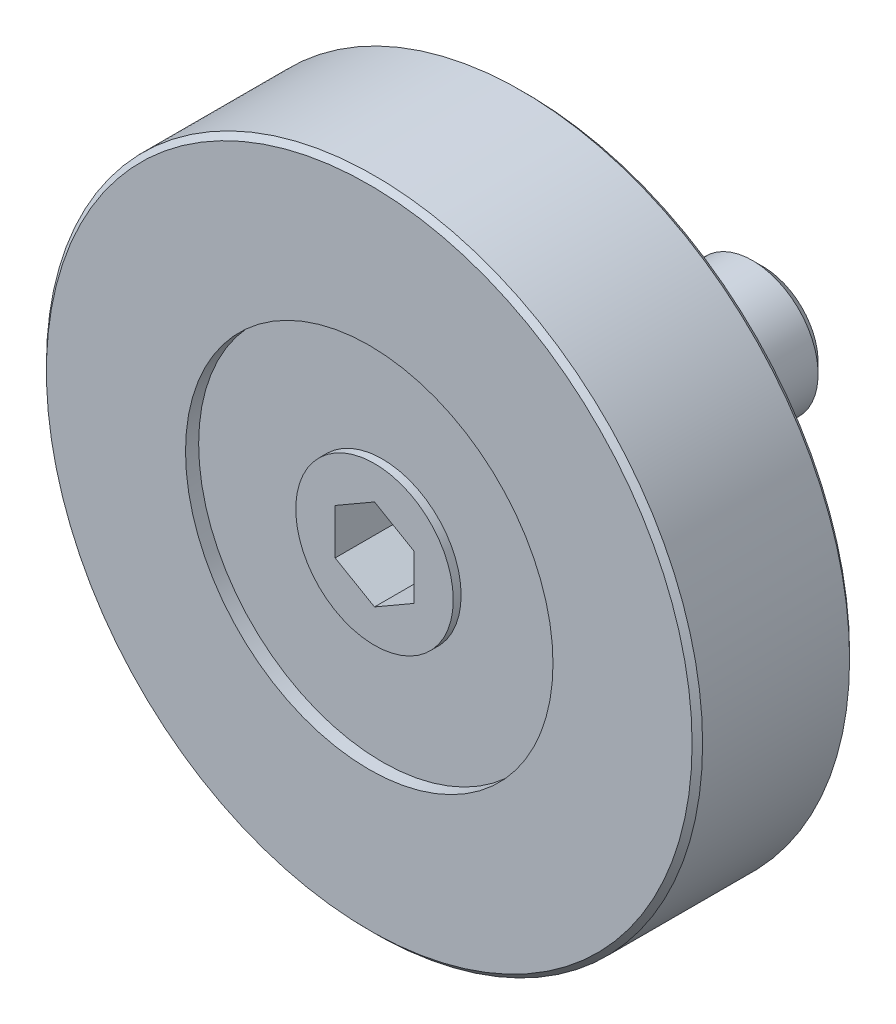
ISO-10303-21;
HEADER;
FILE_DESCRIPTION(('STEP AP214'),'2;1');
FILE_NAME('part.step','',(''),(''),'','','');
FILE_SCHEMA(('AUTOMOTIVE_DESIGN { 1 0 10303 214 1 1 1 1 }'));
ENDSEC;
DATA;
#1=APPLICATION_CONTEXT('core data for automotive mechanical design processes');
#2=APPLICATION_PROTOCOL_DEFINITION('international standard','automotive_design',2000,#1);
#3=PRODUCT_CONTEXT('',#1,'mechanical');
#4=PRODUCT('Part','Part','',(#3));
#5=PRODUCT_RELATED_PRODUCT_CATEGORY('part','',(#4));
#6=PRODUCT_DEFINITION_FORMATION('','',#4);
#7=PRODUCT_DEFINITION_CONTEXT('part definition',#1,'design');
#8=PRODUCT_DEFINITION('design','',#6,#7);
#9=PRODUCT_DEFINITION_SHAPE('','',#8);
#10=(LENGTH_UNIT() NAMED_UNIT(*) SI_UNIT(.MILLI.,.METRE.));
#11=(NAMED_UNIT(*) PLANE_ANGLE_UNIT() SI_UNIT($,.RADIAN.));
#12=(NAMED_UNIT(*) SI_UNIT($,.STERADIAN.) SOLID_ANGLE_UNIT());
#13=UNCERTAINTY_MEASURE_WITH_UNIT(LENGTH_MEASURE(1.E-05),#10,'distance_accuracy_value','');
#14=(GEOMETRIC_REPRESENTATION_CONTEXT(3) GLOBAL_UNCERTAINTY_ASSIGNED_CONTEXT((#13)) GLOBAL_UNIT_ASSIGNED_CONTEXT((#10,
#11,#12)) REPRESENTATION_CONTEXT('',''));
#15=CARTESIAN_POINT('',(0.,0.,0.));
#16=DIRECTION('',(0.,0.,1.));
#17=DIRECTION('',(1.,0.,0.));
#18=AXIS2_PLACEMENT_3D('',#15,#16,#17);
#19=CARTESIAN_POINT('',(0.,3.99999999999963,-3.05311331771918E-13));
#20=DIRECTION('',(0.,0.,1.));
#21=DIRECTION('',(1.,0.,0.));
#22=AXIS2_PLACEMENT_3D('',#19,#20,#21);
#23=PLANE('',#22);
#24=CARTESIAN_POINT('',(0.,0.,-3.05311331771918E-13));
#25=DIRECTION('',(0.,0.,1.));
#26=DIRECTION('',(1.,0.,0.));
#27=AXIS2_PLACEMENT_3D('',#24,#25,#26);
#28=CIRCLE('',#27,3.99999999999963);
#29=CARTESIAN_POINT('',(3.99999999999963,0.,-3.05311331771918E-13));
#30=VERTEX_POINT('',#29);
#31=EDGE_CURVE('E9',#30,#30,#28,.T.);
#32=ORIENTED_EDGE('',*,*,#31,.F.);
#33=EDGE_LOOP('',(#32));
#34=FACE_BOUND('',#33,.T.);
#35=CARTESIAN_POINT('',(0.,0.,-3.05311331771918E-13));
#36=DIRECTION('',(0.,0.,-1.));
#37=DIRECTION('',(-1.,0.,0.));
#38=AXIS2_PLACEMENT_3D('',#35,#36,#37);
#39=CIRCLE('',#38,2.);
#40=CARTESIAN_POINT('',(-2.,0.,-3.05311331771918E-13));
#41=VERTEX_POINT('',#40);
#42=EDGE_CURVE('E104',#41,#41,#39,.T.);
#43=ORIENTED_EDGE('',*,*,#42,.F.);
#44=EDGE_LOOP('',(#43));
#45=FACE_BOUND('',#44,.T.);
#46=ADVANCED_FACE('F14',(#34,#45),#23,.F.);
#47=CARTESIAN_POINT('',(0.,0.,10.));
#48=DIRECTION('',(0.,0.,1.));
#49=DIRECTION('',(1.,0.,0.));
#50=AXIS2_PLACEMENT_3D('',#47,#48,#49);
#51=CYLINDRICAL_SURFACE('',#50,3.99999999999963);
#52=CARTESIAN_POINT('',(0.,0.,1.49999999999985));
#53=DIRECTION('',(0.,0.,1.));
#54=DIRECTION('',(1.,0.,0.));
#55=AXIS2_PLACEMENT_3D('',#52,#53,#54);
#56=CIRCLE('',#55,3.99999999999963);
#57=CARTESIAN_POINT('',(3.99999999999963,0.,1.49999999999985));
#58=VERTEX_POINT('',#57);
#59=EDGE_CURVE('E22',#58,#58,#56,.T.);
#60=ORIENTED_EDGE('',*,*,#59,.F.);
#61=EDGE_LOOP('',(#60));
#62=FACE_BOUND('',#61,.T.);
#63=ORIENTED_EDGE('',*,*,#31,.T.);
#64=EDGE_LOOP('',(#63));
#65=FACE_BOUND('',#64,.T.);
#66=ADVANCED_FACE('F156',(#62,#65),#51,.T.);
#67=CARTESIAN_POINT('',(0.,3.99999999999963,1.49999999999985));
#68=DIRECTION('',(0.,0.,1.));
#69=DIRECTION('',(1.,0.,0.));
#70=AXIS2_PLACEMENT_3D('',#67,#68,#69);
#71=PLANE('',#70);
#72=CARTESIAN_POINT('',(0.,0.,1.49999999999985));
#73=DIRECTION('',(0.,0.,1.));
#74=DIRECTION('',(1.,0.,0.));
#75=AXIS2_PLACEMENT_3D('',#72,#73,#74);
#76=CIRCLE('',#75,6.99999999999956);
#77=CARTESIAN_POINT('',(6.99999999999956,0.,1.49999999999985));
#78=VERTEX_POINT('',#77);
#79=EDGE_CURVE('E149',#78,#78,#76,.T.);
#80=ORIENTED_EDGE('',*,*,#79,.F.);
#81=EDGE_LOOP('',(#80));
#82=FACE_BOUND('',#81,.T.);
#83=ORIENTED_EDGE('',*,*,#59,.T.);
#84=EDGE_LOOP('',(#83));
#85=FACE_BOUND('',#84,.T.);
#86=ADVANCED_FACE('F154',(#82,#85),#71,.F.);
#87=CARTESIAN_POINT('',(0.,0.,10.));
#88=DIRECTION('',(0.,0.,1.));
#89=DIRECTION('',(1.,0.,0.));
#90=AXIS2_PLACEMENT_3D('',#87,#88,#89);
#91=CYLINDRICAL_SURFACE('',#90,6.99999999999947);
#92=CARTESIAN_POINT('',(0.,0.,0.999999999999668));
#93=DIRECTION('',(0.,0.,1.));
#94=DIRECTION('',(1.,0.,0.));
#95=AXIS2_PLACEMENT_3D('',#92,#93,#94);
#96=CIRCLE('',#95,6.99999999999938);
#97=CARTESIAN_POINT('',(6.99999999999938,0.,0.999999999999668));
#98=VERTEX_POINT('',#97);
#99=EDGE_CURVE('E146',#98,#98,#96,.T.);
#100=ORIENTED_EDGE('',*,*,#99,.F.);
#101=EDGE_LOOP('',(#100));
#102=FACE_BOUND('',#101,.T.);
#103=ORIENTED_EDGE('',*,*,#79,.T.);
#104=EDGE_LOOP('',(#103));
#105=FACE_BOUND('',#104,.T.);
#106=ADVANCED_FACE('F237',(#102,#105),#91,.F.);
#107=CARTESIAN_POINT('',(0.,12.2999999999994,0.999999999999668));
#108=DIRECTION('',(0.,0.,1.));
#109=DIRECTION('',(1.,0.,0.));
#110=AXIS2_PLACEMENT_3D('',#107,#108,#109);
#111=PLANE('',#110);
#112=CARTESIAN_POINT('',(0.,0.,0.999999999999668));
#113=DIRECTION('',(0.,0.,1.));
#114=DIRECTION('',(1.,0.,0.));
#115=AXIS2_PLACEMENT_3D('',#112,#113,#114);
#116=CIRCLE('',#115,12.2999999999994);
#117=CARTESIAN_POINT('',(12.2999999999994,0.,0.999999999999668));
#118=VERTEX_POINT('',#117);
#119=EDGE_CURVE('E143',#118,#118,#116,.T.);
#120=ORIENTED_EDGE('',*,*,#119,.F.);
#121=EDGE_LOOP('',(#120));
#122=FACE_BOUND('',#121,.T.);
#123=ORIENTED_EDGE('',*,*,#99,.T.);
#124=EDGE_LOOP('',(#123));
#125=FACE_BOUND('',#124,.T.);
#126=ADVANCED_FACE('F233',(#122,#125),#111,.F.);
#127=CARTESIAN_POINT('',(0.,0.,0.999999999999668));
#128=DIRECTION('',(0.,0.,1.));
#129=DIRECTION('',(1.,0.,0.));
#130=AXIS2_PLACEMENT_3D('',#127,#128,#129);
#131=CONICAL_SURFACE('',#130,12.2999999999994,0.785398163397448);
#132=CARTESIAN_POINT('',(0.,0.,1.2));
#133=DIRECTION('',(0.,0.,1.));
#134=DIRECTION('',(1.,0.,0.));
#135=AXIS2_PLACEMENT_3D('',#132,#133,#134);
#136=CIRCLE('',#135,12.4999999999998);
#137=CARTESIAN_POINT('',(12.4999999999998,0.,1.2));
#138=VERTEX_POINT('',#137);
#139=EDGE_CURVE('E140',#138,#138,#136,.T.);
#140=ORIENTED_EDGE('',*,*,#139,.F.);
#141=EDGE_LOOP('',(#140));
#142=FACE_BOUND('',#141,.T.);
#143=ORIENTED_EDGE('',*,*,#119,.T.);
#144=EDGE_LOOP('',(#143));
#145=FACE_BOUND('',#144,.T.);
#146=ADVANCED_FACE('F229',(#142,#145),#131,.T.);
#147=CARTESIAN_POINT('',(0.,0.,10.));
#148=DIRECTION('',(0.,0.,1.));
#149=DIRECTION('',(1.,0.,0.));
#150=AXIS2_PLACEMENT_3D('',#147,#148,#149);
#151=CYLINDRICAL_SURFACE('',#150,12.4999999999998);
#152=CARTESIAN_POINT('',(0.,0.,6.8));
#153=DIRECTION('',(0.,0.,1.));
#154=DIRECTION('',(1.,0.,0.));
#155=AXIS2_PLACEMENT_3D('',#152,#153,#154);
#156=CIRCLE('',#155,12.4999999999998);
#157=CARTESIAN_POINT('',(12.4999999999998,0.,6.8));
#158=VERTEX_POINT('',#157);
#159=EDGE_CURVE('E137',#158,#158,#156,.T.);
#160=ORIENTED_EDGE('',*,*,#159,.F.);
#161=EDGE_LOOP('',(#160));
#162=FACE_BOUND('',#161,.T.);
#163=ORIENTED_EDGE('',*,*,#139,.T.);
#164=EDGE_LOOP('',(#163));
#165=FACE_BOUND('',#164,.T.);
#166=ADVANCED_FACE('F225',(#162,#165),#151,.T.);
#167=CARTESIAN_POINT('',(0.,0.,6.8));
#168=DIRECTION('',(0.,0.,-1.));
#169=DIRECTION('',(-1.,0.,0.));
#170=AXIS2_PLACEMENT_3D('',#167,#168,#169);
#171=CONICAL_SURFACE('',#170,12.4999999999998,0.785398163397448);
#172=CARTESIAN_POINT('',(0.,0.,7.));
#173=DIRECTION('',(0.,0.,1.));
#174=DIRECTION('',(1.,0.,0.));
#175=AXIS2_PLACEMENT_3D('',#172,#173,#174);
#176=CIRCLE('',#175,12.2999999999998);
#177=CARTESIAN_POINT('',(12.2999999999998,0.,7.));
#178=VERTEX_POINT('',#177);
#179=EDGE_CURVE('E134',#178,#178,#176,.T.);
#180=ORIENTED_EDGE('',*,*,#179,.F.);
#181=EDGE_LOOP('',(#180));
#182=FACE_BOUND('',#181,.T.);
#183=ORIENTED_EDGE('',*,*,#159,.T.);
#184=EDGE_LOOP('',(#183));
#185=FACE_BOUND('',#184,.T.);
#186=ADVANCED_FACE('F221',(#182,#185),#171,.T.);
#187=CARTESIAN_POINT('',(0.,12.2999999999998,7.));
#188=DIRECTION('',(0.,0.,-1.));
#189=DIRECTION('',(-1.,0.,0.));
#190=AXIS2_PLACEMENT_3D('',#187,#188,#189);
#191=PLANE('',#190);
#192=CARTESIAN_POINT('',(0.,0.,7.));
#193=DIRECTION('',(0.,0.,1.));
#194=DIRECTION('',(1.,0.,0.));
#195=AXIS2_PLACEMENT_3D('',#192,#193,#194);
#196=CIRCLE('',#195,6.99999999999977);
#197=CARTESIAN_POINT('',(6.99999999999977,0.,7.));
#198=VERTEX_POINT('',#197);
#199=EDGE_CURVE('E131',#198,#198,#196,.T.);
#200=ORIENTED_EDGE('',*,*,#199,.F.);
#201=EDGE_LOOP('',(#200));
#202=FACE_BOUND('',#201,.T.);
#203=ORIENTED_EDGE('',*,*,#179,.T.);
#204=EDGE_LOOP('',(#203));
#205=FACE_BOUND('',#204,.T.);
#206=ADVANCED_FACE('F217',(#202,#205),#191,.F.);
#207=CARTESIAN_POINT('',(0.,0.,10.));
#208=DIRECTION('',(0.,0.,1.));
#209=DIRECTION('',(1.,0.,0.));
#210=AXIS2_PLACEMENT_3D('',#207,#208,#209);
#211=CYLINDRICAL_SURFACE('',#210,6.99999999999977);
#212=CARTESIAN_POINT('',(0.,0.,6.5));
#213=DIRECTION('',(0.,0.,1.));
#214=DIRECTION('',(1.,0.,0.));
#215=AXIS2_PLACEMENT_3D('',#212,#213,#214);
#216=CIRCLE('',#215,6.99999999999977);
#217=CARTESIAN_POINT('',(6.99999999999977,0.,6.5));
#218=VERTEX_POINT('',#217);
#219=EDGE_CURVE('E128',#218,#218,#216,.T.);
#220=ORIENTED_EDGE('',*,*,#219,.F.);
#221=EDGE_LOOP('',(#220));
#222=FACE_BOUND('',#221,.T.);
#223=ORIENTED_EDGE('',*,*,#199,.T.);
#224=EDGE_LOOP('',(#223));
#225=FACE_BOUND('',#224,.T.);
#226=ADVANCED_FACE('F213',(#222,#225),#211,.F.);
#227=CARTESIAN_POINT('',(0.,3.,6.5));
#228=DIRECTION('',(0.,0.,-1.));
#229=DIRECTION('',(-1.,0.,0.));
#230=AXIS2_PLACEMENT_3D('',#227,#228,#229);
#231=PLANE('',#230);
#232=CARTESIAN_POINT('',(0.,0.,6.5));
#233=DIRECTION('',(0.,0.,1.));
#234=DIRECTION('',(1.,0.,0.));
#235=AXIS2_PLACEMENT_3D('',#232,#233,#234);
#236=CIRCLE('',#235,3.);
#237=CARTESIAN_POINT('',(3.,0.,6.5));
#238=VERTEX_POINT('',#237);
#239=EDGE_CURVE('E125',#238,#238,#236,.T.);
#240=ORIENTED_EDGE('',*,*,#239,.F.);
#241=EDGE_LOOP('',(#240));
#242=FACE_BOUND('',#241,.T.);
#243=ORIENTED_EDGE('',*,*,#219,.T.);
#244=EDGE_LOOP('',(#243));
#245=FACE_BOUND('',#244,.T.);
#246=ADVANCED_FACE('F209',(#242,#245),#231,.F.);
#247=CARTESIAN_POINT('',(0.,0.,10.));
#248=DIRECTION('',(0.,0.,1.));
#249=DIRECTION('',(1.,0.,0.));
#250=AXIS2_PLACEMENT_3D('',#247,#248,#249);
#251=CYLINDRICAL_SURFACE('',#250,3.);
#252=CARTESIAN_POINT('',(0.,0.,6.8));
#253=DIRECTION('',(0.,0.,1.));
#254=DIRECTION('',(1.,0.,0.));
#255=AXIS2_PLACEMENT_3D('',#252,#253,#254);
#256=CIRCLE('',#255,3.);
#257=CARTESIAN_POINT('',(3.,0.,6.8));
#258=VERTEX_POINT('',#257);
#259=EDGE_CURVE('E117',#258,#258,#256,.T.);
#260=ORIENTED_EDGE('',*,*,#259,.F.);
#261=EDGE_LOOP('',(#260));
#262=FACE_BOUND('',#261,.T.);
#263=ORIENTED_EDGE('',*,*,#239,.T.);
#264=EDGE_LOOP('',(#263));
#265=FACE_BOUND('',#264,.T.);
#266=ADVANCED_FACE('F206',(#262,#265),#251,.T.);
#267=CARTESIAN_POINT('',(0.,3.,6.8));
#268=DIRECTION('',(0.,0.,-1.));
#269=DIRECTION('',(-1.,0.,0.));
#270=AXIS2_PLACEMENT_3D('',#267,#268,#269);
#271=PLANE('',#270);
#272=DIRECTION('',(-0.866025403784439,-0.5,0.));
#273=VECTOR('',#272,1.);
#274=CARTESIAN_POINT('',(0.,1.73205080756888,6.8));
#275=LINE('',#274,#273);
#276=CARTESIAN_POINT('',(0.,1.73205080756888,6.8));
#277=VERTEX_POINT('',#276);
#278=CARTESIAN_POINT('',(-1.5,0.86602540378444,6.8));
#279=VERTEX_POINT('',#278);
#280=EDGE_CURVE('E103',#277,#279,#275,.T.);
#281=ORIENTED_EDGE('',*,*,#280,.F.);
#282=DIRECTION('',(-0.866025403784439,0.5,0.));
#283=VECTOR('',#282,1.);
#284=CARTESIAN_POINT('',(1.5,0.86602540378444,6.8));
#285=LINE('',#284,#283);
#286=CARTESIAN_POINT('',(1.5,0.86602540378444,6.8));
#287=VERTEX_POINT('',#286);
#288=EDGE_CURVE('E29',#287,#277,#285,.T.);
#289=ORIENTED_EDGE('',*,*,#288,.F.);
#290=DIRECTION('',(0.,1.,0.));
#291=VECTOR('',#290,1.);
#292=CARTESIAN_POINT('',(1.5,-0.866025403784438,6.8));
#293=LINE('',#292,#291);
#294=CARTESIAN_POINT('',(1.5,-0.866025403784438,6.8));
#295=VERTEX_POINT('',#294);
#296=EDGE_CURVE('E113',#295,#287,#293,.T.);
#297=ORIENTED_EDGE('',*,*,#296,.F.);
#298=DIRECTION('',(0.866025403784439,0.5,0.));
#299=VECTOR('',#298,1.);
#300=CARTESIAN_POINT('',(0.,-1.73205080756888,6.8));
#301=LINE('',#300,#299);
#302=CARTESIAN_POINT('',(0.,-1.73205080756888,6.8));
#303=VERTEX_POINT('',#302);
#304=EDGE_CURVE('E111',#303,#295,#301,.T.);
#305=ORIENTED_EDGE('',*,*,#304,.F.);
#306=DIRECTION('',(0.866025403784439,-0.5,0.));
#307=VECTOR('',#306,1.);
#308=CARTESIAN_POINT('',(-1.5,-0.866025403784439,6.8));
#309=LINE('',#308,#307);
#310=CARTESIAN_POINT('',(-1.5,-0.866025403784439,6.8));
#311=VERTEX_POINT('',#310);
#312=EDGE_CURVE('E77',#311,#303,#309,.T.);
#313=ORIENTED_EDGE('',*,*,#312,.F.);
#314=DIRECTION('',(0.,-1.,0.));
#315=VECTOR('',#314,1.);
#316=CARTESIAN_POINT('',(-1.5,0.86602540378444,6.8));
#317=LINE('',#316,#315);
#318=EDGE_CURVE('E107',#279,#311,#317,.T.);
#319=ORIENTED_EDGE('',*,*,#318,.F.);
#320=EDGE_LOOP('',(#281,#289,#297,#305,#313,#319));
#321=FACE_BOUND('',#320,.T.);
#322=ORIENTED_EDGE('',*,*,#259,.T.);
#323=EDGE_LOOP('',(#322));
#324=FACE_BOUND('',#323,.T.);
#325=ADVANCED_FACE('F181',(#321,#324),#271,.F.);
#326=CARTESIAN_POINT('',(1.5,0.86602540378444,4.3));
#327=DIRECTION('',(0.5,0.866025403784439,0.));
#328=DIRECTION('',(-0.866025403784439,0.5,0.));
#329=AXIS2_PLACEMENT_3D('',#326,#327,#328);
#330=PLANE('',#329);
#331=ORIENTED_EDGE('',*,*,#288,.T.);
#332=DIRECTION('',(0.,0.,1.));
#333=VECTOR('',#332,1.);
#334=CARTESIAN_POINT('',(0.,1.73205080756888,4.3));
#335=LINE('',#334,#333);
#336=CARTESIAN_POINT('',(0.,1.73205080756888,4.3));
#337=VERTEX_POINT('',#336);
#338=EDGE_CURVE('E59',#337,#277,#335,.T.);
#339=ORIENTED_EDGE('',*,*,#338,.F.);
#340=DIRECTION('',(-0.866025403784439,0.5,0.));
#341=VECTOR('',#340,1.);
#342=CARTESIAN_POINT('',(1.5,0.86602540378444,4.3));
#343=LINE('',#342,#341);
#344=CARTESIAN_POINT('',(1.5,0.86602540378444,4.3));
#345=VERTEX_POINT('',#344);
#346=EDGE_CURVE('E115',#345,#337,#343,.T.);
#347=ORIENTED_EDGE('',*,*,#346,.F.);
#348=DIRECTION('',(0.,0.,1.));
#349=VECTOR('',#348,1.);
#350=CARTESIAN_POINT('',(1.5,0.86602540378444,4.3));
#351=LINE('',#350,#349);
#352=EDGE_CURVE('E37',#345,#287,#351,.T.);
#353=ORIENTED_EDGE('',*,*,#352,.T.);
#354=EDGE_LOOP('',(#331,#339,#347,#353));
#355=FACE_BOUND('',#354,.T.);
#356=ADVANCED_FACE('F186',(#355),#330,.F.);
#357=CARTESIAN_POINT('',(1.5,-0.866025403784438,4.3));
#358=DIRECTION('',(1.,0.,0.));
#359=DIRECTION('',(0.,1.,0.));
#360=AXIS2_PLACEMENT_3D('',#357,#358,#359);
#361=PLANE('',#360);
#362=ORIENTED_EDGE('',*,*,#296,.T.);
#363=ORIENTED_EDGE('',*,*,#352,.F.);
#364=DIRECTION('',(0.,1.,0.));
#365=VECTOR('',#364,1.);
#366=CARTESIAN_POINT('',(1.5,-0.866025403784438,4.3));
#367=LINE('',#366,#365);
#368=CARTESIAN_POINT('',(1.5,-0.866025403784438,4.3));
#369=VERTEX_POINT('',#368);
#370=EDGE_CURVE('E89',#369,#345,#367,.T.);
#371=ORIENTED_EDGE('',*,*,#370,.F.);
#372=DIRECTION('',(0.,0.,1.));
#373=VECTOR('',#372,1.);
#374=CARTESIAN_POINT('',(1.5,-0.866025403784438,4.3));
#375=LINE('',#374,#373);
#376=EDGE_CURVE('E81',#369,#295,#375,.T.);
#377=ORIENTED_EDGE('',*,*,#376,.T.);
#378=EDGE_LOOP('',(#362,#363,#371,#377));
#379=FACE_BOUND('',#378,.T.);
#380=ADVANCED_FACE('F184',(#379),#361,.F.);
#381=CARTESIAN_POINT('',(0.,-1.73205080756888,4.3));
#382=DIRECTION('',(0.5,-0.866025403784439,0.));
#383=DIRECTION('',(0.866025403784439,0.5,0.));
#384=AXIS2_PLACEMENT_3D('',#381,#382,#383);
#385=PLANE('',#384);
#386=ORIENTED_EDGE('',*,*,#304,.T.);
#387=ORIENTED_EDGE('',*,*,#376,.F.);
#388=DIRECTION('',(0.866025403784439,0.5,0.));
#389=VECTOR('',#388,1.);
#390=CARTESIAN_POINT('',(0.,-1.73205080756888,4.3));
#391=LINE('',#390,#389);
#392=CARTESIAN_POINT('',(0.,-1.73205080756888,4.3));
#393=VERTEX_POINT('',#392);
#394=EDGE_CURVE('E85',#393,#369,#391,.T.);
#395=ORIENTED_EDGE('',*,*,#394,.F.);
#396=DIRECTION('',(0.,0.,1.));
#397=VECTOR('',#396,1.);
#398=CARTESIAN_POINT('',(0.,-1.73205080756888,4.3));
#399=LINE('',#398,#397);
#400=EDGE_CURVE('E70',#393,#303,#399,.T.);
#401=ORIENTED_EDGE('',*,*,#400,.T.);
#402=EDGE_LOOP('',(#386,#387,#395,#401));
#403=FACE_BOUND('',#402,.T.);
#404=ADVANCED_FACE('F86',(#403),#385,.F.);
#405=CARTESIAN_POINT('',(-1.5,-0.866025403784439,4.3));
#406=DIRECTION('',(-0.5,-0.866025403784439,0.));
#407=DIRECTION('',(0.866025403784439,-0.5,0.));
#408=AXIS2_PLACEMENT_3D('',#405,#406,#407);
#409=PLANE('',#408);
#410=ORIENTED_EDGE('',*,*,#312,.T.);
#411=ORIENTED_EDGE('',*,*,#400,.F.);
#412=DIRECTION('',(0.866025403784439,-0.5,0.));
#413=VECTOR('',#412,1.);
#414=CARTESIAN_POINT('',(-1.5,-0.866025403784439,4.3));
#415=LINE('',#414,#413);
#416=CARTESIAN_POINT('',(-1.5,-0.866025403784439,4.3));
#417=VERTEX_POINT('',#416);
#418=EDGE_CURVE('E74',#417,#393,#415,.T.);
#419=ORIENTED_EDGE('',*,*,#418,.F.);
#420=DIRECTION('',(0.,0.,1.));
#421=VECTOR('',#420,1.);
#422=CARTESIAN_POINT('',(-1.5,-0.866025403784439,4.3));
#423=LINE('',#422,#421);
#424=EDGE_CURVE('E82',#417,#311,#423,.T.);
#425=ORIENTED_EDGE('',*,*,#424,.T.);
#426=EDGE_LOOP('',(#410,#411,#419,#425));
#427=FACE_BOUND('',#426,.T.);
#428=ADVANCED_FACE('F72',(#427),#409,.F.);
#429=CARTESIAN_POINT('',(-1.5,0.86602540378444,4.3));
#430=DIRECTION('',(-1.,0.,0.));
#431=DIRECTION('',(0.,-1.,0.));
#432=AXIS2_PLACEMENT_3D('',#429,#430,#431);
#433=PLANE('',#432);
#434=ORIENTED_EDGE('',*,*,#318,.T.);
#435=ORIENTED_EDGE('',*,*,#424,.F.);
#436=DIRECTION('',(0.,-1.,0.));
#437=VECTOR('',#436,1.);
#438=CARTESIAN_POINT('',(-1.5,0.86602540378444,4.3));
#439=LINE('',#438,#437);
#440=CARTESIAN_POINT('',(-1.5,0.86602540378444,4.3));
#441=VERTEX_POINT('',#440);
#442=EDGE_CURVE('E95',#441,#417,#439,.T.);
#443=ORIENTED_EDGE('',*,*,#442,.F.);
#444=DIRECTION('',(0.,0.,1.));
#445=VECTOR('',#444,1.);
#446=CARTESIAN_POINT('',(-1.5,0.86602540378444,4.3));
#447=LINE('',#446,#445);
#448=EDGE_CURVE('E120',#441,#279,#447,.T.);
#449=ORIENTED_EDGE('',*,*,#448,.T.);
#450=EDGE_LOOP('',(#434,#435,#443,#449));
#451=FACE_BOUND('',#450,.T.);
#452=ADVANCED_FACE('F179',(#451),#433,.F.);
#453=CARTESIAN_POINT('',(0.,1.73205080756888,4.3));
#454=DIRECTION('',(-0.5,0.866025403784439,0.));
#455=DIRECTION('',(-0.866025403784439,-0.5,0.));
#456=AXIS2_PLACEMENT_3D('',#453,#454,#455);
#457=PLANE('',#456);
#458=ORIENTED_EDGE('',*,*,#280,.T.);
#459=ORIENTED_EDGE('',*,*,#448,.F.);
#460=DIRECTION('',(-0.866025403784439,-0.5,0.));
#461=VECTOR('',#460,1.);
#462=CARTESIAN_POINT('',(0.,1.73205080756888,4.3));
#463=LINE('',#462,#461);
#464=EDGE_CURVE('E97',#337,#441,#463,.T.);
#465=ORIENTED_EDGE('',*,*,#464,.F.);
#466=ORIENTED_EDGE('',*,*,#338,.T.);
#467=EDGE_LOOP('',(#458,#459,#465,#466));
#468=FACE_BOUND('',#467,.T.);
#469=ADVANCED_FACE('F175',(#468),#457,.F.);
#470=CARTESIAN_POINT('',(0.,0.,4.3));
#471=DIRECTION('',(0.,0.,1.));
#472=DIRECTION('',(1.,0.,0.));
#473=AXIS2_PLACEMENT_3D('',#470,#471,#472);
#474=PLANE('',#473);
#475=ORIENTED_EDGE('',*,*,#346,.T.);
#476=ORIENTED_EDGE('',*,*,#464,.T.);
#477=ORIENTED_EDGE('',*,*,#442,.T.);
#478=ORIENTED_EDGE('',*,*,#418,.T.);
#479=ORIENTED_EDGE('',*,*,#394,.T.);
#480=ORIENTED_EDGE('',*,*,#370,.T.);
#481=EDGE_LOOP('',(#475,#476,#477,#478,#479,#480));
#482=FACE_BOUND('',#481,.T.);
#483=ADVANCED_FACE('F92',(#482),#474,.T.);
#484=CARTESIAN_POINT('',(0.,0.,-8.00000000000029));
#485=DIRECTION('',(0.,0.,-1.));
#486=DIRECTION('',(-1.,0.,0.));
#487=AXIS2_PLACEMENT_3D('',#484,#485,#486);
#488=CYLINDRICAL_SURFACE('',#487,2.);
#489=CARTESIAN_POINT('',(0.,0.,-1.60000000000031));
#490=DIRECTION('',(0.,0.,-1.));
#491=DIRECTION('',(-1.,0.,0.));
#492=AXIS2_PLACEMENT_3D('',#489,#490,#491);
#493=CIRCLE('',#492,2.);
#494=CARTESIAN_POINT('',(-2.,0.,-1.60000000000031));
#495=VERTEX_POINT('',#494);
#496=EDGE_CURVE('E167',#495,#495,#493,.T.);
#497=ORIENTED_EDGE('',*,*,#496,.F.);
#498=EDGE_LOOP('',(#497));
#499=FACE_BOUND('',#498,.T.);
#500=ORIENTED_EDGE('',*,*,#42,.T.);
#501=EDGE_LOOP('',(#500));
#502=FACE_BOUND('',#501,.T.);
#503=ADVANCED_FACE('F349',(#499,#502),#488,.T.);
#504=CARTESIAN_POINT('',(0.,2.,-1.60000000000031));
#505=DIRECTION('',(0.,0.,-1.));
#506=DIRECTION('',(-1.,0.,0.));
#507=AXIS2_PLACEMENT_3D('',#504,#505,#506);
#508=PLANE('',#507);
#509=CARTESIAN_POINT('',(0.,0.,-1.60000000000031));
#510=DIRECTION('',(0.,0.,-1.));
#511=DIRECTION('',(-1.,0.,0.));
#512=AXIS2_PLACEMENT_3D('',#509,#510,#511);
#513=CIRCLE('',#512,2.5);
#514=CARTESIAN_POINT('',(-2.5,0.,-1.60000000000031));
#515=VERTEX_POINT('',#514);
#516=EDGE_CURVE('E170',#515,#515,#513,.T.);
#517=ORIENTED_EDGE('',*,*,#516,.F.);
#518=EDGE_LOOP('',(#517));
#519=FACE_BOUND('',#518,.T.);
#520=ORIENTED_EDGE('',*,*,#496,.T.);
#521=EDGE_LOOP('',(#520));
#522=FACE_BOUND('',#521,.T.);
#523=ADVANCED_FACE('F358',(#519,#522),#508,.F.);
#524=CARTESIAN_POINT('',(0.,0.,-8.00000000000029));
#525=DIRECTION('',(0.,0.,-1.));
#526=DIRECTION('',(-1.,0.,0.));
#527=AXIS2_PLACEMENT_3D('',#524,#525,#526);
#528=CYLINDRICAL_SURFACE('',#527,2.5);
#529=CARTESIAN_POINT('',(0.,0.,-7.60000000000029));
#530=DIRECTION('',(0.,0.,-1.));
#531=DIRECTION('',(-1.,0.,0.));
#532=AXIS2_PLACEMENT_3D('',#529,#530,#531);
#533=CIRCLE('',#532,2.5);
#534=CARTESIAN_POINT('',(-2.5,0.,-7.60000000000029));
#535=VERTEX_POINT('',#534);
#536=EDGE_CURVE('E402',#535,#535,#533,.T.);
#537=ORIENTED_EDGE('',*,*,#536,.F.);
#538=EDGE_LOOP('',(#537));
#539=FACE_BOUND('',#538,.T.);
#540=ORIENTED_EDGE('',*,*,#516,.T.);
#541=EDGE_LOOP('',(#540));
#542=FACE_BOUND('',#541,.T.);
#543=ADVANCED_FACE('F367',(#539,#542),#528,.T.);
#544=CARTESIAN_POINT('',(0.,0.,-7.60000000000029));
#545=DIRECTION('',(0.,0.,1.));
#546=DIRECTION('',(1.,0.,0.));
#547=AXIS2_PLACEMENT_3D('',#544,#545,#546);
#548=CONICAL_SURFACE('',#547,2.5,0.785398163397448);
#549=CARTESIAN_POINT('',(0.,0.,-8.00000000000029));
#550=DIRECTION('',(0.,0.,-1.));
#551=DIRECTION('',(-1.,0.,0.));
#552=AXIS2_PLACEMENT_3D('',#549,#550,#551);
#553=CIRCLE('',#552,2.1);
#554=CARTESIAN_POINT('',(-2.1,0.,-8.00000000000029));
#555=VERTEX_POINT('',#554);
#556=EDGE_CURVE('E401',#555,#555,#553,.T.);
#557=ORIENTED_EDGE('',*,*,#556,.F.);
#558=EDGE_LOOP('',(#557));
#559=FACE_BOUND('',#558,.T.);
#560=ORIENTED_EDGE('',*,*,#536,.T.);
#561=EDGE_LOOP('',(#560));
#562=FACE_BOUND('',#561,.T.);
#563=ADVANCED_FACE('F377',(#559,#562),#548,.T.);
#564=CARTESIAN_POINT('',(0.,0.,-8.00000000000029));
#565=DIRECTION('',(0.,0.,1.));
#566=DIRECTION('',(1.,0.,0.));
#567=AXIS2_PLACEMENT_3D('',#564,#565,#566);
#568=PLANE('',#567);
#569=ORIENTED_EDGE('',*,*,#556,.T.);
#570=EDGE_LOOP('',(#569));
#571=FACE_BOUND('',#570,.T.);
#572=ADVANCED_FACE('F16',(#571),#568,.F.);
#573=CLOSED_SHELL('',(#46,#66,#86,#106,#126,#146,#166,#186,#206,#226,#246,#266,#325,#356,#380,
#404,#428,#452,#469,#483,#503,#523,#543,#563,#572));
#574=MANIFOLD_SOLID_BREP('B1',#573);
#575=ADVANCED_BREP_SHAPE_REPRESENTATION('',(#18,#574),#14);
#576=SHAPE_DEFINITION_REPRESENTATION(#9,#575);
ENDSEC;
END-ISO-10303-21;
